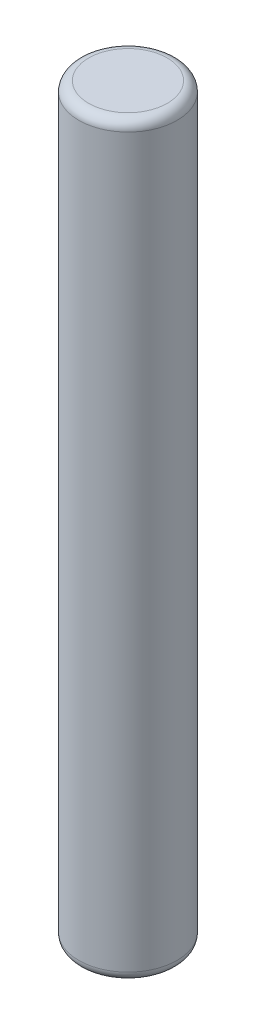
from build123d import *

# Parameters (mm, degrees)
SKETCH_1_R      = 1.25
EXTRUDE_1_DEPTH = 9.5
FILLET_1_R      = 0.25


with BuildPart() as part:
    # Sketch 1 → Extrude 1 (new, symmetric)
    with BuildSketch(Plane(origin=(0, 0, 0), x_dir=(1, 0, 0), z_dir=(0, 1, 0))):
        with Locations(Location((0, 0, 0), (0, 0, 270))):
            Circle(SKETCH_1_R)
    extrude(amount=EXTRUDE_1_DEPTH, both=True)

    # Fillet 1
    fillet_1_edges = [part.edges().sort_by_distance(p)[0] for p in [
        (0, -9.5, -1.25),
        (0, 9.5, -1.25),
    ]]
    fillet(fillet_1_edges, radius=FILLET_1_R)


solid = part.part
